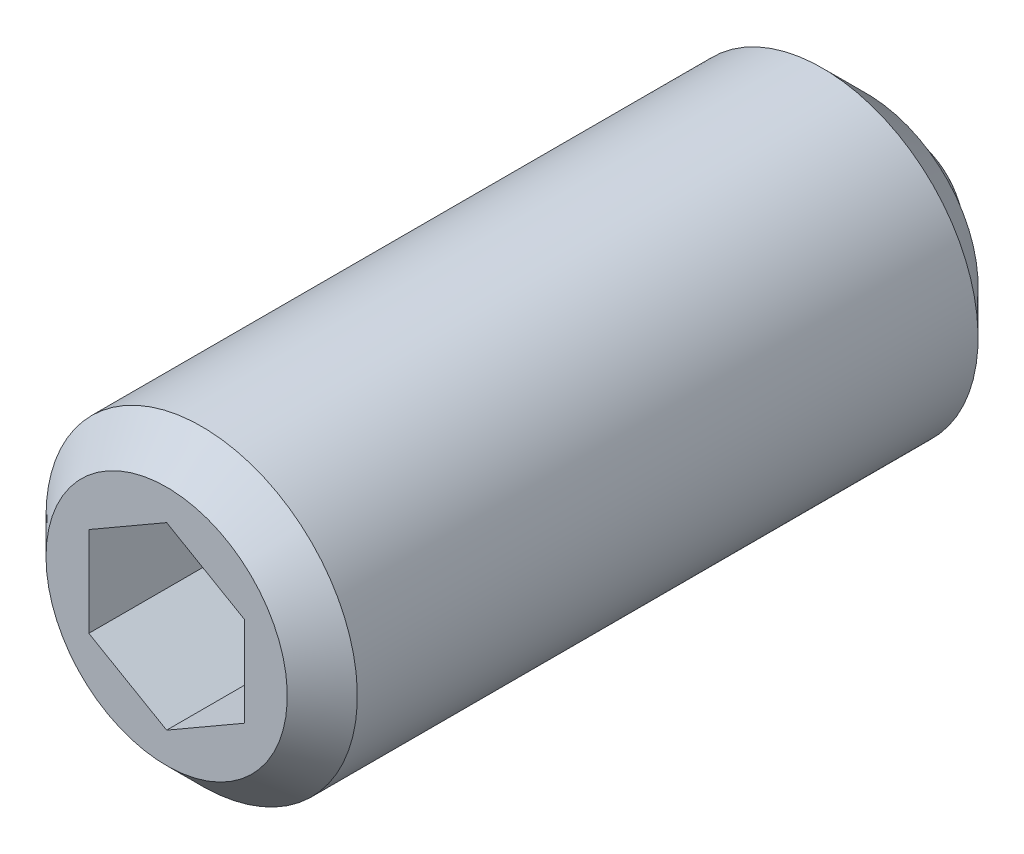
ISO-10303-21;
HEADER;
FILE_DESCRIPTION(('STEP AP214'),'2;1');
FILE_NAME('part.step','',(''),(''),'','','');
FILE_SCHEMA(('AUTOMOTIVE_DESIGN { 1 0 10303 214 1 1 1 1 }'));
ENDSEC;
DATA;
#1=APPLICATION_CONTEXT('core data for automotive mechanical design processes');
#2=APPLICATION_PROTOCOL_DEFINITION('international standard','automotive_design',2000,#1);
#3=PRODUCT_CONTEXT('',#1,'mechanical');
#4=PRODUCT('Part','Part','',(#3));
#5=PRODUCT_RELATED_PRODUCT_CATEGORY('part','',(#4));
#6=PRODUCT_DEFINITION_FORMATION('','',#4);
#7=PRODUCT_DEFINITION_CONTEXT('part definition',#1,'design');
#8=PRODUCT_DEFINITION('design','',#6,#7);
#9=PRODUCT_DEFINITION_SHAPE('','',#8);
#10=(LENGTH_UNIT() NAMED_UNIT(*) SI_UNIT(.MILLI.,.METRE.));
#11=(NAMED_UNIT(*) PLANE_ANGLE_UNIT() SI_UNIT($,.RADIAN.));
#12=(NAMED_UNIT(*) SI_UNIT($,.STERADIAN.) SOLID_ANGLE_UNIT());
#13=UNCERTAINTY_MEASURE_WITH_UNIT(LENGTH_MEASURE(1.E-05),#10,'distance_accuracy_value','');
#14=(GEOMETRIC_REPRESENTATION_CONTEXT(3) GLOBAL_UNCERTAINTY_ASSIGNED_CONTEXT((#13)) GLOBAL_UNIT_ASSIGNED_CONTEXT((#10,
#11,#12)) REPRESENTATION_CONTEXT('',''));
#15=CARTESIAN_POINT('',(0.,0.,0.));
#16=DIRECTION('',(0.,0.,1.));
#17=DIRECTION('',(1.,0.,0.));
#18=AXIS2_PLACEMENT_3D('',#15,#16,#17);
#19=CARTESIAN_POINT('',(1.02399998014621,2.9006077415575,15.499999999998));
#20=DIRECTION('',(-1.90434005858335E-12,0.,-1.));
#21=DIRECTION('',(0.500000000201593,-0.866025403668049,-9.37835111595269E-13));
#22=AXIS2_PLACEMENT_3D('',#19,#20,#21);
#23=PLANE('',#22);
#24=DIRECTION('',(0.866025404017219,-0.499999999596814,-1.64093059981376E-12));
#25=VECTOR('',#24,1.);
#26=CARTESIAN_POINT('',(-1.00000001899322,-1.73205081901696,15.500000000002));
#27=LINE('',#26,#25);
#28=CARTESIAN_POINT('',(-2.00000001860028,-1.15470055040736,15.5000000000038));
#29=VERTEX_POINT('',#28);
#30=CARTESIAN_POINT('',(-1.85747970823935E-08,-2.30940108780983,15.5));
#31=VERTEX_POINT('',#30);
#32=EDGE_CURVE('E77',#29,#31,#27,.T.);
#33=ORIENTED_EDGE('',*,*,#32,.T.);
#34=DIRECTION('',(0.866025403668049,0.500000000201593,-1.65748313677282E-12));
#35=VECTOR('',#34,1.);
#36=CARTESIAN_POINT('',(0.999999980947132,-1.73205081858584,15.4999999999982));
#37=LINE('',#36,#35);
#38=CARTESIAN_POINT('',(1.99999998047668,-1.15470054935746,15.4999999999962));
#39=VERTEX_POINT('',#38);
#40=EDGE_CURVE('E72',#31,#39,#37,.T.);
#41=ORIENTED_EDGE('',*,*,#40,.T.);
#42=DIRECTION('',(0.,1.,0.));
#43=VECTOR('',#42,1.);
#44=CARTESIAN_POINT('',(1.99999998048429,-1.08186246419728E-08,15.4999999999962));
#45=LINE('',#44,#43);
#46=CARTESIAN_POINT('',(1.99999997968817,1.15470052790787,15.4999999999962));
#47=VERTEX_POINT('',#46);
#48=EDGE_CURVE('E74',#39,#47,#45,.T.);
#49=ORIENTED_EDGE('',*,*,#48,.T.);
#50=DIRECTION('',(-0.866025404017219,0.499999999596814,1.64093059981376E-12));
#51=VECTOR('',#50,1.);
#52=CARTESIAN_POINT('',(0.999999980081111,1.73205079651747,15.4999999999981));
#53=LINE('',#52,#51);
#54=CARTESIAN_POINT('',(-2.03296927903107E-08,2.30940106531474,15.5));
#55=VERTEX_POINT('',#54);
#56=EDGE_CURVE('E90',#47,#55,#53,.T.);
#57=ORIENTED_EDGE('',*,*,#56,.T.);
#58=DIRECTION('',(-0.866025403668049,-0.500000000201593,1.65748313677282E-12));
#59=VECTOR('',#58,1.);
#60=CARTESIAN_POINT('',(-1.00000001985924,1.73205079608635,15.5000000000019));
#61=LINE('',#60,#59);
#62=CARTESIAN_POINT('',(-2.00000001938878,1.15470052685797,15.5000000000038));
#63=VERTEX_POINT('',#62);
#64=EDGE_CURVE('E95',#55,#63,#61,.T.);
#65=ORIENTED_EDGE('',*,*,#64,.T.);
#66=DIRECTION('',(0.,-1.,0.));
#67=VECTOR('',#66,1.);
#68=CARTESIAN_POINT('',(-2.0000000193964,-1.16808639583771E-08,15.5000000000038));
#69=LINE('',#68,#67);
#70=EDGE_CURVE('E98',#63,#29,#69,.T.);
#71=ORIENTED_EDGE('',*,*,#70,.T.);
#72=EDGE_LOOP('',(#33,#41,#49,#57,#65,#71));
#73=FACE_BOUND('',#72,.T.);
#74=ADVANCED_FACE('F14',(#73),#23,.F.);
#75=CARTESIAN_POINT('',(1.99999998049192,-1.154700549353,19.4999999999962));
#76=DIRECTION('',(0.500000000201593,-0.866025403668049,-9.37835111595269E-13));
#77=DIRECTION('',(-0.866025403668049,-0.500000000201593,1.65748313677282E-12));
#78=AXIS2_PLACEMENT_3D('',#75,#76,#77);
#79=PLANE('',#78);
#80=DIRECTION('',(-1.90434005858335E-12,0.,-1.));
#81=VECTOR('',#80,1.);
#82=CARTESIAN_POINT('',(1.99999998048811,-1.15470054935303,17.4999999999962));
#83=LINE('',#82,#81);
#84=CARTESIAN_POINT('',(1.99999998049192,-1.15470055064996,19.4999999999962));
#85=VERTEX_POINT('',#84);
#86=EDGE_CURVE('E78',#85,#39,#83,.T.);
#87=ORIENTED_EDGE('',*,*,#86,.T.);
#88=ORIENTED_EDGE('',*,*,#40,.F.);
#89=DIRECTION('',(1.90434005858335E-12,0.,1.));
#90=VECTOR('',#89,1.);
#91=CARTESIAN_POINT('',(-1.85862215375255E-08,-2.30940108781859,17.5));
#92=LINE('',#91,#90);
#93=CARTESIAN_POINT('',(-1.74592146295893E-08,-2.30940108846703,19.5));
#94=VERTEX_POINT('',#93);
#95=EDGE_CURVE('E52',#31,#94,#92,.T.);
#96=ORIENTED_EDGE('',*,*,#95,.T.);
#97=DIRECTION('',(0.866025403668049,0.500000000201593,-1.65748313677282E-12));
#98=VECTOR('',#97,1.);
#99=CARTESIAN_POINT('',(0.99999998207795,-1.73205082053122,19.4999999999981));
#100=LINE('',#99,#98);
#101=EDGE_CURVE('E46',#94,#85,#100,.T.);
#102=ORIENTED_EDGE('',*,*,#101,.T.);
#103=EDGE_LOOP('',(#87,#88,#96,#102));
#104=FACE_BOUND('',#103,.T.);
#105=ADVANCED_FACE('F81',(#104),#79,.F.);
#106=CARTESIAN_POINT('',(1.99999998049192,1.15470052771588,19.4999999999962));
#107=DIRECTION('',(1.,0.,-1.90434005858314E-12));
#108=DIRECTION('',(0.,-1.,0.));
#109=AXIS2_PLACEMENT_3D('',#106,#107,#108);
#110=PLANE('',#109);
#111=DIRECTION('',(-1.90434005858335E-12,0.,-1.));
#112=VECTOR('',#111,1.);
#113=CARTESIAN_POINT('',(1.99999998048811,1.15470052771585,17.4999999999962));
#114=LINE('',#113,#112);
#115=CARTESIAN_POINT('',(1.99999998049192,1.15470052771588,19.4999999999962));
#116=VERTEX_POINT('',#115);
#117=EDGE_CURVE('E87',#116,#47,#114,.T.);
#118=ORIENTED_EDGE('',*,*,#117,.T.);
#119=ORIENTED_EDGE('',*,*,#48,.F.);
#120=ORIENTED_EDGE('',*,*,#86,.F.);
#121=DIRECTION('',(0.,-1.,0.));
#122=VECTOR('',#121,1.);
#123=CARTESIAN_POINT('',(1.99999998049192,1.15470052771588,19.4999999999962));
#124=LINE('',#123,#122);
#125=EDGE_CURVE('E115',#85,#116,#124,.F.);
#126=ORIENTED_EDGE('',*,*,#125,.T.);
#127=EDGE_LOOP('',(#118,#119,#120,#126));
#128=FACE_BOUND('',#127,.T.);
#129=ADVANCED_FACE('F85',(#128),#110,.F.);
#130=CARTESIAN_POINT('',(-2.03144577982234E-08,2.3094010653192,19.5));
#131=DIRECTION('',(0.499999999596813,0.866025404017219,-9.66504946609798E-13));
#132=DIRECTION('',(0.866025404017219,-0.499999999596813,-1.64093059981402E-12));
#133=AXIS2_PLACEMENT_3D('',#130,#131,#132);
#134=PLANE('',#133);
#135=DIRECTION('',(-1.90434005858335E-12,0.,-1.));
#136=VECTOR('',#135,1.);
#137=CARTESIAN_POINT('',(-2.03182681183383E-08,2.30940106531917,17.5));
#138=LINE('',#137,#136);
#139=CARTESIAN_POINT('',(-2.14376580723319E-08,2.30940106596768,19.5));
#140=VERTEX_POINT('',#139);
#141=EDGE_CURVE('E94',#140,#55,#138,.T.);
#142=ORIENTED_EDGE('',*,*,#141,.T.);
#143=ORIENTED_EDGE('',*,*,#56,.F.);
#144=ORIENTED_EDGE('',*,*,#117,.F.);
#145=DIRECTION('',(0.866025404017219,-0.499999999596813,-1.64093059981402E-12));
#146=VECTOR('',#145,1.);
#147=CARTESIAN_POINT('',(-2.03144577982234E-08,2.3094010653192,19.5));
#148=LINE('',#147,#146);
#149=EDGE_CURVE('E109',#116,#140,#148,.F.);
#150=ORIENTED_EDGE('',*,*,#149,.T.);
#151=EDGE_LOOP('',(#142,#143,#144,#150));
#152=FACE_BOUND('',#151,.T.);
#153=ADVANCED_FACE('F163',(#152),#134,.F.);
#154=CARTESIAN_POINT('',(-2.00000001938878,1.15470052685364,19.5000000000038));
#155=DIRECTION('',(-0.500000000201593,0.866025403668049,9.37835111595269E-13));
#156=DIRECTION('',(0.866025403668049,0.500000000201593,-1.65748313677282E-12));
#157=AXIS2_PLACEMENT_3D('',#154,#155,#156);
#158=PLANE('',#157);
#159=DIRECTION('',(-1.90434005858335E-12,0.,-1.));
#160=VECTOR('',#159,1.);
#161=CARTESIAN_POINT('',(-2.00000001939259,1.15470052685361,17.5000000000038));
#162=LINE('',#161,#160);
#163=CARTESIAN_POINT('',(-2.00000001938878,1.1547005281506,19.5000000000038));
#164=VERTEX_POINT('',#163);
#165=EDGE_CURVE('E97',#164,#63,#162,.T.);
#166=ORIENTED_EDGE('',*,*,#165,.T.);
#167=ORIENTED_EDGE('',*,*,#64,.F.);
#168=ORIENTED_EDGE('',*,*,#141,.F.);
#169=DIRECTION('',(-0.866025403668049,-0.500000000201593,1.65748313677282E-12));
#170=VECTOR('',#169,1.);
#171=CARTESIAN_POINT('',(-1.00000002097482,1.73205079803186,19.5000000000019));
#172=LINE('',#171,#170);
#173=EDGE_CURVE('E107',#140,#164,#172,.T.);
#174=ORIENTED_EDGE('',*,*,#173,.T.);
#175=EDGE_LOOP('',(#166,#167,#168,#174));
#176=FACE_BOUND('',#175,.T.);
#177=ADVANCED_FACE('F160',(#176),#158,.F.);
#178=CARTESIAN_POINT('',(-2.00000001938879,-1.15470055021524,19.5000000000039));
#179=DIRECTION('',(-1.,0.,1.90434005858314E-12));
#180=DIRECTION('',(0.,1.,0.));
#181=AXIS2_PLACEMENT_3D('',#178,#179,#180);
#182=PLANE('',#181);
#183=DIRECTION('',(-1.90434005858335E-12,0.,-1.));
#184=VECTOR('',#183,1.);
#185=CARTESIAN_POINT('',(-2.00000001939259,-1.15470055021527,17.5000000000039));
#186=LINE('',#185,#184);
#187=CARTESIAN_POINT('',(-2.00000001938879,-1.15470055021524,19.5000000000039));
#188=VERTEX_POINT('',#187);
#189=EDGE_CURVE('E100',#188,#29,#186,.T.);
#190=ORIENTED_EDGE('',*,*,#189,.T.);
#191=ORIENTED_EDGE('',*,*,#70,.F.);
#192=ORIENTED_EDGE('',*,*,#165,.F.);
#193=DIRECTION('',(0.,1.,0.));
#194=VECTOR('',#193,1.);
#195=CARTESIAN_POINT('',(-2.00000001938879,-1.15470055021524,19.5000000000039));
#196=LINE('',#195,#194);
#197=EDGE_CURVE('E31',#164,#188,#196,.F.);
#198=ORIENTED_EDGE('',*,*,#197,.T.);
#199=EDGE_LOOP('',(#190,#191,#192,#198));
#200=FACE_BOUND('',#199,.T.);
#201=ADVANCED_FACE('F153',(#200),#182,.F.);
#202=CARTESIAN_POINT('',(-1.85824146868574E-08,-2.30940108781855,19.5));
#203=DIRECTION('',(-0.499999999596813,-0.866025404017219,9.66504946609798E-13));
#204=DIRECTION('',(-0.866025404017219,0.499999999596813,1.64093059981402E-12));
#205=AXIS2_PLACEMENT_3D('',#202,#203,#204);
#206=PLANE('',#205);
#207=ORIENTED_EDGE('',*,*,#95,.F.);
#208=ORIENTED_EDGE('',*,*,#32,.F.);
#209=ORIENTED_EDGE('',*,*,#189,.F.);
#210=DIRECTION('',(-0.866025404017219,0.499999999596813,1.64093059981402E-12));
#211=VECTOR('',#210,1.);
#212=CARTESIAN_POINT('',(-1.85824146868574E-08,-2.30940108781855,19.5));
#213=LINE('',#212,#211);
#214=EDGE_CURVE('E106',#188,#94,#213,.F.);
#215=ORIENTED_EDGE('',*,*,#214,.T.);
#216=EDGE_LOOP('',(#207,#208,#209,#215));
#217=FACE_BOUND('',#216,.T.);
#218=ADVANCED_FACE('F144',(#217),#206,.F.);
#219=CARTESIAN_POINT('',(1.04561359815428,3.8756447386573,19.499999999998));
#220=DIRECTION('',(-1.90434005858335E-12,0.,-1.));
#221=DIRECTION('',(0.500000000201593,-0.866025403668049,-9.37835111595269E-13));
#222=AXIS2_PLACEMENT_3D('',#219,#220,#221);
#223=PLANE('',#222);
#224=CARTESIAN_POINT('',(-1.94484369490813E-08,-1.12496772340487E-08,19.5));
#225=DIRECTION('',(-1.90434005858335E-12,0.,-1.));
#226=DIRECTION('',(-1.,0.,1.90434005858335E-12));
#227=AXIS2_PLACEMENT_3D('',#224,#225,#226);
#228=CIRCLE('',#227,3.10000003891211);
#229=CARTESIAN_POINT('',(-3.10000005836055,-1.12496772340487E-08,19.5000000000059));
#230=VERTEX_POINT('',#229);
#231=EDGE_CURVE('E9',#230,#230,#228,.F.);
#232=ORIENTED_EDGE('',*,*,#231,.T.);
#233=EDGE_LOOP('',(#232));
#234=FACE_BOUND('',#233,.T.);
#235=ORIENTED_EDGE('',*,*,#197,.F.);
#236=ORIENTED_EDGE('',*,*,#173,.F.);
#237=ORIENTED_EDGE('',*,*,#149,.F.);
#238=ORIENTED_EDGE('',*,*,#125,.F.);
#239=ORIENTED_EDGE('',*,*,#101,.F.);
#240=ORIENTED_EDGE('',*,*,#214,.F.);
#241=EDGE_LOOP('',(#235,#236,#237,#238,#239,#240));
#242=FACE_BOUND('',#241,.T.);
#243=ADVANCED_FACE('F141',(#234,#242),#223,.F.);
#244=CARTESIAN_POINT('',(3.94848527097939,-1.05072825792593,1.4999999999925));
#245=DIRECTION('',(1.90434005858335E-12,0.,1.));
#246=DIRECTION('',(-0.500000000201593,0.866025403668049,9.37835111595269E-13));
#247=AXIS2_PLACEMENT_3D('',#244,#245,#246);
#248=PLANE('',#247);
#249=CARTESIAN_POINT('',(-1.90366954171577E-12,0.,1.5));
#250=DIRECTION('',(1.90434005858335E-12,0.,1.));
#251=DIRECTION('',(1.,0.,-1.90434005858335E-12));
#252=AXIS2_PLACEMENT_3D('',#249,#250,#251);
#253=CIRCLE('',#252,2.29128784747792);
#254=CARTESIAN_POINT('',(2.29128784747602,0.,1.49999999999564));
#255=VERTEX_POINT('',#254);
#256=EDGE_CURVE('E79',#255,#255,#253,.T.);
#257=ORIENTED_EDGE('',*,*,#256,.T.);
#258=EDGE_LOOP('',(#257));
#259=FACE_BOUND('',#258,.T.);
#260=CARTESIAN_POINT('',(-1.94827150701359E-08,-1.1249975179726E-08,1.49999999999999));
#261=DIRECTION('',(1.90434005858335E-12,0.,1.));
#262=DIRECTION('',(-0.500000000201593,0.866025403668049,9.37835111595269E-13));
#263=AXIS2_PLACEMENT_3D('',#260,#261,#262);
#264=CIRCLE('',#263,2.85);
#265=CARTESIAN_POINT('',(-1.42500002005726,2.46817238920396,1.50000000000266));
#266=VERTEX_POINT('',#265);
#267=EDGE_CURVE('E105',#266,#266,#264,.T.);
#268=ORIENTED_EDGE('',*,*,#267,.F.);
#269=EDGE_LOOP('',(#268));
#270=FACE_BOUND('',#269,.T.);
#271=ADVANCED_FACE('F143',(#259,#270),#248,.F.);
#272=CARTESIAN_POINT('',(-1.94827150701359E-08,-1.1249975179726E-08,1.5));
#273=DIRECTION('',(1.90434005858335E-12,0.,1.));
#274=DIRECTION('',(-0.500000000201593,0.866025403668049,9.37835111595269E-13));
#275=AXIS2_PLACEMENT_3D('',#272,#273,#274);
#276=CONICAL_SURFACE('',#275,2.85,0.785398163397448);
#277=CARTESIAN_POINT('',(-1.94805250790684E-08,-1.12499561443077E-08,2.65));
#278=DIRECTION('',(1.90434005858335E-12,0.,1.));
#279=DIRECTION('',(-0.500000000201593,0.866025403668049,9.45641367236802E-13));
#280=AXIS2_PLACEMENT_3D('',#277,#278,#279);
#281=CIRCLE('',#280,4.);
#282=CARTESIAN_POINT('',(-2.0000000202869,3.46410160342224,2.65000000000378));
#283=VERTEX_POINT('',#282);
#284=EDGE_CURVE('E102',#283,#283,#281,.F.);
#285=ORIENTED_EDGE('',*,*,#284,.T.);
#286=EDGE_LOOP('',(#285));
#287=FACE_BOUND('',#286,.T.);
#288=ORIENTED_EDGE('',*,*,#267,.T.);
#289=EDGE_LOOP('',(#288));
#290=FACE_BOUND('',#289,.T.);
#291=ADVANCED_FACE('F151',(#287,#290),#276,.T.);
#292=CARTESIAN_POINT('',(-1.94805250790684E-08,-1.12499561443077E-08,2.65));
#293=DIRECTION('',(1.90434005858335E-12,0.,1.));
#294=DIRECTION('',(-0.500000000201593,0.866025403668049,9.37835111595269E-13));
#295=AXIS2_PLACEMENT_3D('',#292,#293,#294);
#296=CYLINDRICAL_SURFACE('',#295,4.);
#297=CARTESIAN_POINT('',(-1.945015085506E-08,-1.12496921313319E-08,18.6000000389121));
#298=DIRECTION('',(-1.90434005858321E-12,0.,-1.));
#299=DIRECTION('',(-1.,0.,1.90434005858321E-12));
#300=AXIS2_PLACEMENT_3D('',#297,#298,#299);
#301=CIRCLE('',#300,4.);
#302=CARTESIAN_POINT('',(-4.00000001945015,-1.12496921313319E-08,18.6000000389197));
#303=VERTEX_POINT('',#302);
#304=EDGE_CURVE('E23',#303,#303,#301,.T.);
#305=ORIENTED_EDGE('',*,*,#304,.T.);
#306=EDGE_LOOP('',(#305));
#307=FACE_BOUND('',#306,.T.);
#308=ORIENTED_EDGE('',*,*,#284,.F.);
#309=EDGE_LOOP('',(#308));
#310=FACE_BOUND('',#309,.T.);
#311=ADVANCED_FACE('F128',(#307,#310),#296,.T.);
#312=CARTESIAN_POINT('',(0.,0.,2.5));
#313=DIRECTION('',(0.,0.,-1.));
#314=DIRECTION('',(1.,0.,0.));
#315=AXIS2_PLACEMENT_3D('',#312,#313,#314);
#316=SPHERICAL_SURFACE('',#315,2.5);
#317=ORIENTED_EDGE('',*,*,#256,.F.);
#318=EDGE_LOOP('',(#317));
#319=FACE_BOUND('',#318,.T.);
#320=ADVANCED_FACE('F132',(#319),#316,.T.);
#321=CARTESIAN_POINT('',(-1.945015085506E-08,-1.12496921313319E-08,18.6000000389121));
#322=DIRECTION('',(-1.90434005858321E-12,0.,-1.));
#323=DIRECTION('',(-1.,0.,1.90434005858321E-12));
#324=AXIS2_PLACEMENT_3D('',#321,#322,#323);
#325=CONICAL_SURFACE('',#324,4.,0.78539816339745);
#326=ORIENTED_EDGE('',*,*,#231,.F.);
#327=EDGE_LOOP('',(#326));
#328=FACE_BOUND('',#327,.T.);
#329=ORIENTED_EDGE('',*,*,#304,.F.);
#330=EDGE_LOOP('',(#329));
#331=FACE_BOUND('',#330,.T.);
#332=ADVANCED_FACE('F16',(#328,#331),#325,.T.);
#333=CLOSED_SHELL('',(#74,#105,#129,#153,#177,#201,#218,#243,#271,#291,#311,#320,#332));
#334=MANIFOLD_SOLID_BREP('B1',#333);
#335=ADVANCED_BREP_SHAPE_REPRESENTATION('',(#18,#334),#14);
#336=SHAPE_DEFINITION_REPRESENTATION(#9,#335);
ENDSEC;
END-ISO-10303-21;
